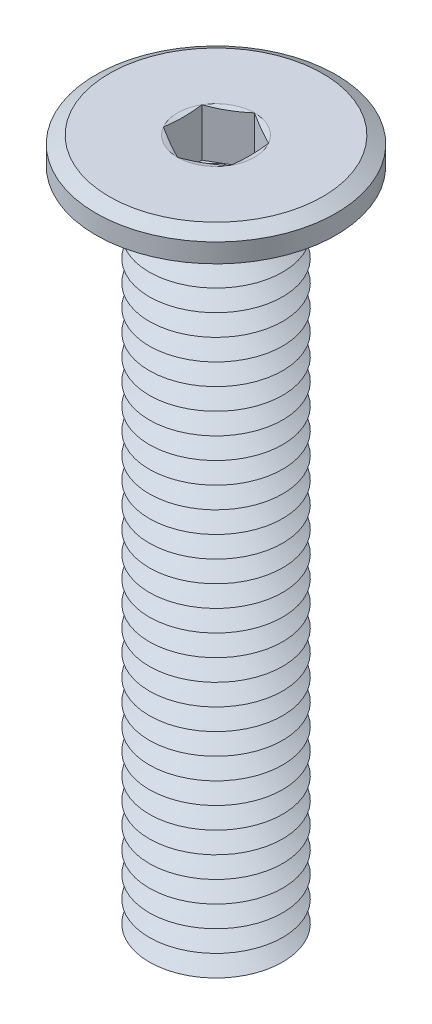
from build123d import *

# Parameters (mm, degrees)
SKETCH1_R           = 4.5
BOSS_EXTRUDE1_DEPTH = 1
SKETCH2_R           = 2.5
BOSS_EXTRUDE2_DEPTH = 25
LPATTERN1_COUNT     = 30
LPATTERN1_PITCH     = 0.8
FILLET1_R           = 0.2
CHAMFER2_SIZE       = 0.5
CHAMFER2_SIZE2      = 0.288675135
CUT_EXTRUDE1_DEPTH  = 1.8


with BuildPart() as part:
    # Sketch1 → Boss-Extrude1 (new body)
    with BuildSketch(Plane(origin=(0, 0, 0), x_dir=(1, 0, 0), z_dir=(0, 1, 0))):
        with Locations(Location((0, 0, 0), (0, 0, 270))):
            Circle(SKETCH1_R)
    extrude(amount=-BOSS_EXTRUDE1_DEPTH)

    # Sketch2 → Boss-Extrude2 (add)
    with BuildSketch(Plane.XZ.offset(1)):
        with Locations(Location((0, 0, 0), (0, 0, 270))):
            Circle(SKETCH2_R)
    extrude(amount=BOSS_EXTRUDE2_DEPTH)

    # Sketch5 → Cut-Revolve1 (revolve, cut)
    with BuildSketch(Plane(origin=(0, 0, 0), x_dir=(0, 0, -1), z_dir=(1, 0, 0))):
        Polygon((-2.5, -26.4), (-1.807179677, -26), (-2.5, -25.6), align=None)
    cut_revolve1 = revolve(axis=Axis((0, 0.990593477, 0), (0, -1, 0)), mode=Mode.SUBTRACT)

    # LPattern1: Cut-Revolve1 ×30
    with Locations(*[(0, i * LPATTERN1_PITCH, 0) for i in range(1, LPATTERN1_COUNT)]):
        add(cut_revolve1, mode=Mode.SUBTRACT)

    # Fillet1
    fillet1_edges = [part.edges().sort_by_distance(p)[0] for p in [
        (0, -1, 2.5),
    ]]
    fillet(fillet1_edges, radius=FILLET1_R)

    # Chamfer2
    chamfer2_edges = [part.edges().sort_by_distance(p)[0] for p in [
        (0, 0, -4.5),
    ]]
    chamfer2_side = [part.faces().sort_by_distance(p)[0] for p in [
        (0, 0, 0),
    ]]
    chamfer(chamfer2_edges, length=CHAMFER2_SIZE, length2=CHAMFER2_SIZE2, reference=chamfer2_side[0])

    # Sketch6 → Cut-Extrude1 (cut)
    with BuildSketch(Plane(origin=(0, 0, 0), x_dir=(1, 0, 0), z_dir=(0, 1, 0))):
        Polygon((0, 1.443375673), (-1.25, 0.721687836), (-1.25, -0.721687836), (0, -1.443375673), (1.25, -0.721687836), (1.25, 0.721687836), align=None)
    extrude(amount=-CUT_EXTRUDE1_DEPTH, mode=Mode.SUBTRACT)

    # Cut-Extrude2 cone 1 section (on through the dimple's axis) → Cut-Extrude2 (revolve, cut)
    with BuildSketch(Plane(origin=(0, -1.8, 0), x_dir=(0, 0, 1), z_dir=(1, 0, 0))):
        Polygon((0, 0), (1.25, 0), (0, 0.721687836), align=None)
    revolve(axis=Axis((0, -1.8, 0), (0, -1, 0)), mode=Mode.SUBTRACT)

    # Cut-Extrude3 cone 1 section (on through the dimple's axis) → Cut-Extrude3 (revolve, cut)
    with BuildSketch(Plane(origin=(0, 0, 0), x_dir=(0, 0, 1), z_dir=(1, 0, 0))):
        Polygon((0, 0), (1.443375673, 0), (0, 0.386751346), align=None)
    revolve(axis=Axis((0, 0, 0), (0, -1, 0)), mode=Mode.SUBTRACT)


solid = part.part
